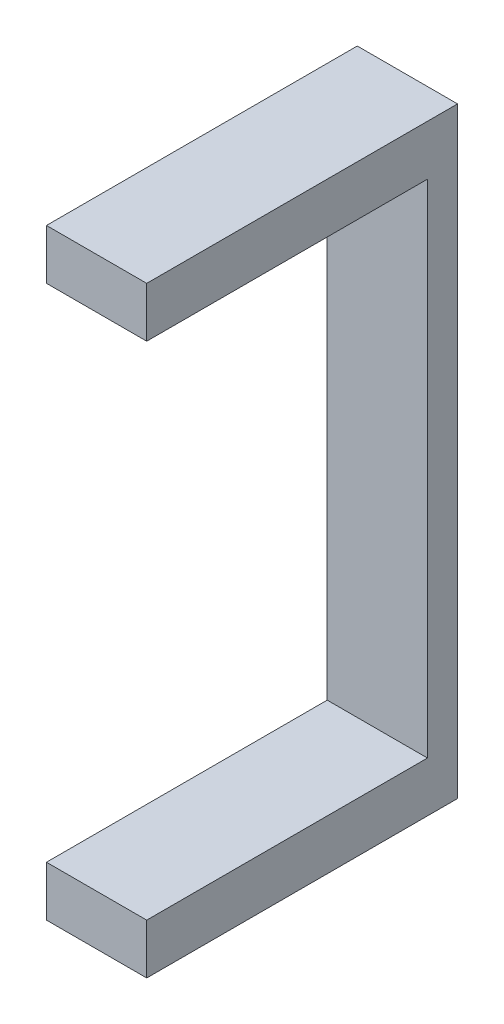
ISO-10303-21;
HEADER;
FILE_DESCRIPTION(('STEP AP214'),'2;1');
FILE_NAME('part.step','',(''),(''),'','','');
FILE_SCHEMA(('AUTOMOTIVE_DESIGN { 1 0 10303 214 1 1 1 1 }'));
ENDSEC;
DATA;
#1=APPLICATION_CONTEXT('core data for automotive mechanical design processes');
#2=APPLICATION_PROTOCOL_DEFINITION('international standard','automotive_design',2000,#1);
#3=PRODUCT_CONTEXT('',#1,'mechanical');
#4=PRODUCT('Part','Part','',(#3));
#5=PRODUCT_RELATED_PRODUCT_CATEGORY('part','',(#4));
#6=PRODUCT_DEFINITION_FORMATION('','',#4);
#7=PRODUCT_DEFINITION_CONTEXT('part definition',#1,'design');
#8=PRODUCT_DEFINITION('design','',#6,#7);
#9=PRODUCT_DEFINITION_SHAPE('','',#8);
#10=(LENGTH_UNIT() NAMED_UNIT(*) SI_UNIT(.MILLI.,.METRE.));
#11=(NAMED_UNIT(*) PLANE_ANGLE_UNIT() SI_UNIT($,.RADIAN.));
#12=(NAMED_UNIT(*) SI_UNIT($,.STERADIAN.) SOLID_ANGLE_UNIT());
#13=UNCERTAINTY_MEASURE_WITH_UNIT(LENGTH_MEASURE(1.E-05),#10,'distance_accuracy_value','');
#14=(GEOMETRIC_REPRESENTATION_CONTEXT(3) GLOBAL_UNCERTAINTY_ASSIGNED_CONTEXT((#13)) GLOBAL_UNIT_ASSIGNED_CONTEXT((#10,
#11,#12)) REPRESENTATION_CONTEXT('',''));
#15=CARTESIAN_POINT('',(0.,0.,0.));
#16=DIRECTION('',(0.,0.,1.));
#17=DIRECTION('',(1.,0.,0.));
#18=AXIS2_PLACEMENT_3D('',#15,#16,#17);
#19=CARTESIAN_POINT('',(0.,0.,3.2));
#20=DIRECTION('',(0.,0.,-1.));
#21=DIRECTION('',(-1.,0.,0.));
#22=AXIS2_PLACEMENT_3D('',#19,#20,#21);
#23=PLANE('',#22);
#24=DIRECTION('',(1.,0.,0.));
#25=VECTOR('',#24,1.);
#26=CARTESIAN_POINT('',(-27.15,5.,3.2));
#27=LINE('',#26,#25);
#28=CARTESIAN_POINT('',(-27.15,5.,3.2));
#29=VERTEX_POINT('',#28);
#30=CARTESIAN_POINT('',(-25.15,5.,3.2));
#31=VERTEX_POINT('',#30);
#32=EDGE_CURVE('E57',#29,#31,#27,.T.);
#33=ORIENTED_EDGE('',*,*,#32,.F.);
#34=DIRECTION('',(0.,-1.,0.));
#35=VECTOR('',#34,1.);
#36=CARTESIAN_POINT('',(-27.15,-6.,3.2));
#37=LINE('',#36,#35);
#38=CARTESIAN_POINT('',(-27.15,-5.,3.2));
#39=VERTEX_POINT('',#38);
#40=EDGE_CURVE('E126',#29,#39,#37,.T.);
#41=ORIENTED_EDGE('',*,*,#40,.T.);
#42=DIRECTION('',(-1.,0.,0.));
#43=VECTOR('',#42,1.);
#44=CARTESIAN_POINT('',(-27.15,-5.,3.2));
#45=LINE('',#44,#43);
#46=CARTESIAN_POINT('',(-25.15,-5.,3.2));
#47=VERTEX_POINT('',#46);
#48=EDGE_CURVE('E61',#47,#39,#45,.T.);
#49=ORIENTED_EDGE('',*,*,#48,.F.);
#50=DIRECTION('',(0.,1.,0.));
#51=VECTOR('',#50,1.);
#52=CARTESIAN_POINT('',(-25.15,-6.,3.2));
#53=LINE('',#52,#51);
#54=EDGE_CURVE('E151',#47,#31,#53,.T.);
#55=ORIENTED_EDGE('',*,*,#54,.T.);
#56=EDGE_LOOP('',(#33,#41,#49,#55));
#57=FACE_BOUND('',#56,.T.);
#58=ADVANCED_FACE('F41',(#57),#23,.F.);
#59=CARTESIAN_POINT('',(-27.15,-6.,3.2));
#60=DIRECTION('',(1.,0.,0.));
#61=DIRECTION('',(0.,0.,-1.));
#62=AXIS2_PLACEMENT_3D('',#59,#60,#61);
#63=PLANE('',#62);
#64=DIRECTION('',(0.,-1.,0.));
#65=VECTOR('',#64,1.);
#66=CARTESIAN_POINT('',(-27.15,-6.,2.6));
#67=LINE('',#66,#65);
#68=CARTESIAN_POINT('',(-27.15,6.,2.6));
#69=VERTEX_POINT('',#68);
#70=CARTESIAN_POINT('',(-27.15,-6.,2.6));
#71=VERTEX_POINT('',#70);
#72=EDGE_CURVE('E149',#69,#71,#67,.T.);
#73=ORIENTED_EDGE('',*,*,#72,.T.);
#74=DIRECTION('',(0.,0.,-1.));
#75=VECTOR('',#74,1.);
#76=CARTESIAN_POINT('',(-27.15,-6.,3.2));
#77=LINE('',#76,#75);
#78=CARTESIAN_POINT('',(-27.15,-6.,8.8));
#79=VERTEX_POINT('',#78);
#80=EDGE_CURVE('E11',#79,#71,#77,.T.);
#81=ORIENTED_EDGE('',*,*,#80,.F.);
#82=DIRECTION('',(0.,-1.,0.));
#83=VECTOR('',#82,1.);
#84=CARTESIAN_POINT('',(-27.15,-6.,8.8));
#85=LINE('',#84,#83);
#86=CARTESIAN_POINT('',(-27.15,-5.,8.8));
#87=VERTEX_POINT('',#86);
#88=EDGE_CURVE('E128',#87,#79,#85,.T.);
#89=ORIENTED_EDGE('',*,*,#88,.F.);
#90=DIRECTION('',(0.,0.,-1.));
#91=VECTOR('',#90,1.);
#92=CARTESIAN_POINT('',(-27.15,-5.,8.8));
#93=LINE('',#92,#91);
#94=EDGE_CURVE('E141',#87,#39,#93,.T.);
#95=ORIENTED_EDGE('',*,*,#94,.T.);
#96=ORIENTED_EDGE('',*,*,#40,.F.);
#97=DIRECTION('',(0.,0.,-1.));
#98=VECTOR('',#97,1.);
#99=CARTESIAN_POINT('',(-27.15,5.,8.8));
#100=LINE('',#99,#98);
#101=CARTESIAN_POINT('',(-27.15,5.,8.8));
#102=VERTEX_POINT('',#101);
#103=EDGE_CURVE('E108',#102,#29,#100,.T.);
#104=ORIENTED_EDGE('',*,*,#103,.F.);
#105=DIRECTION('',(0.,-1.,0.));
#106=VECTOR('',#105,1.);
#107=CARTESIAN_POINT('',(-27.15,5.,8.8));
#108=LINE('',#107,#106);
#109=CARTESIAN_POINT('',(-27.15,6.,8.8));
#110=VERTEX_POINT('',#109);
#111=EDGE_CURVE('E116',#110,#102,#108,.T.);
#112=ORIENTED_EDGE('',*,*,#111,.F.);
#113=DIRECTION('',(0.,0.,-1.));
#114=VECTOR('',#113,1.);
#115=CARTESIAN_POINT('',(-27.15,6.,3.2));
#116=LINE('',#115,#114);
#117=EDGE_CURVE('E152',#110,#69,#116,.T.);
#118=ORIENTED_EDGE('',*,*,#117,.T.);
#119=EDGE_LOOP('',(#73,#81,#89,#95,#96,#104,#112,#118));
#120=FACE_BOUND('',#119,.T.);
#121=ADVANCED_FACE('F43',(#120),#63,.F.);
#122=CARTESIAN_POINT('',(-27.15,-6.,3.2));
#123=DIRECTION('',(0.,1.,0.));
#124=DIRECTION('',(0.,0.,1.));
#125=AXIS2_PLACEMENT_3D('',#122,#123,#124);
#126=PLANE('',#125);
#127=DIRECTION('',(1.,0.,0.));
#128=VECTOR('',#127,1.);
#129=CARTESIAN_POINT('',(-27.15,-6.,2.6));
#130=LINE('',#129,#128);
#131=CARTESIAN_POINT('',(-25.15,-6.,2.6));
#132=VERTEX_POINT('',#131);
#133=EDGE_CURVE('E156',#71,#132,#130,.T.);
#134=ORIENTED_EDGE('',*,*,#133,.T.);
#135=DIRECTION('',(0.,0.,-1.));
#136=VECTOR('',#135,1.);
#137=CARTESIAN_POINT('',(-25.15,-6.,3.2));
#138=LINE('',#137,#136);
#139=CARTESIAN_POINT('',(-25.15,-6.,8.8));
#140=VERTEX_POINT('',#139);
#141=EDGE_CURVE('E47',#140,#132,#138,.T.);
#142=ORIENTED_EDGE('',*,*,#141,.F.);
#143=DIRECTION('',(1.,0.,0.));
#144=VECTOR('',#143,1.);
#145=CARTESIAN_POINT('',(-27.15,-6.,8.8));
#146=LINE('',#145,#144);
#147=EDGE_CURVE('E140',#79,#140,#146,.T.);
#148=ORIENTED_EDGE('',*,*,#147,.F.);
#149=ORIENTED_EDGE('',*,*,#80,.T.);
#150=EDGE_LOOP('',(#134,#142,#148,#149));
#151=FACE_BOUND('',#150,.T.);
#152=ADVANCED_FACE('F179',(#151),#126,.F.);
#153=CARTESIAN_POINT('',(-25.15,-6.,3.2));
#154=DIRECTION('',(-1.,0.,0.));
#155=DIRECTION('',(0.,0.,1.));
#156=AXIS2_PLACEMENT_3D('',#153,#154,#155);
#157=PLANE('',#156);
#158=DIRECTION('',(0.,1.,0.));
#159=VECTOR('',#158,1.);
#160=CARTESIAN_POINT('',(-25.15,-6.,2.6));
#161=LINE('',#160,#159);
#162=CARTESIAN_POINT('',(-25.15,6.,2.6));
#163=VERTEX_POINT('',#162);
#164=EDGE_CURVE('E158',#132,#163,#161,.T.);
#165=ORIENTED_EDGE('',*,*,#164,.T.);
#166=DIRECTION('',(0.,0.,-1.));
#167=VECTOR('',#166,1.);
#168=CARTESIAN_POINT('',(-25.15,6.,3.2));
#169=LINE('',#168,#167);
#170=CARTESIAN_POINT('',(-25.15,6.,8.8));
#171=VERTEX_POINT('',#170);
#172=EDGE_CURVE('E165',#171,#163,#169,.T.);
#173=ORIENTED_EDGE('',*,*,#172,.F.);
#174=DIRECTION('',(0.,1.,0.));
#175=VECTOR('',#174,1.);
#176=CARTESIAN_POINT('',(-25.15,5.,8.8));
#177=LINE('',#176,#175);
#178=CARTESIAN_POINT('',(-25.15,5.,8.8));
#179=VERTEX_POINT('',#178);
#180=EDGE_CURVE('E113',#179,#171,#177,.T.);
#181=ORIENTED_EDGE('',*,*,#180,.F.);
#182=DIRECTION('',(0.,0.,-1.));
#183=VECTOR('',#182,1.);
#184=CARTESIAN_POINT('',(-25.15,5.,8.8));
#185=LINE('',#184,#183);
#186=EDGE_CURVE('E112',#179,#31,#185,.T.);
#187=ORIENTED_EDGE('',*,*,#186,.T.);
#188=ORIENTED_EDGE('',*,*,#54,.F.);
#189=DIRECTION('',(0.,0.,-1.));
#190=VECTOR('',#189,1.);
#191=CARTESIAN_POINT('',(-25.15,-5.,8.8));
#192=LINE('',#191,#190);
#193=CARTESIAN_POINT('',(-25.15,-5.,8.8));
#194=VERTEX_POINT('',#193);
#195=EDGE_CURVE('E148',#194,#47,#192,.T.);
#196=ORIENTED_EDGE('',*,*,#195,.F.);
#197=DIRECTION('',(0.,1.,0.));
#198=VECTOR('',#197,1.);
#199=CARTESIAN_POINT('',(-25.15,-6.,8.8));
#200=LINE('',#199,#198);
#201=EDGE_CURVE('E136',#140,#194,#200,.T.);
#202=ORIENTED_EDGE('',*,*,#201,.F.);
#203=ORIENTED_EDGE('',*,*,#141,.T.);
#204=EDGE_LOOP('',(#165,#173,#181,#187,#188,#196,#202,#203));
#205=FACE_BOUND('',#204,.T.);
#206=ADVANCED_FACE('F169',(#205),#157,.F.);
#207=CARTESIAN_POINT('',(-27.15,6.,3.2));
#208=DIRECTION('',(0.,-1.,0.));
#209=DIRECTION('',(0.,0.,-1.));
#210=AXIS2_PLACEMENT_3D('',#207,#208,#209);
#211=PLANE('',#210);
#212=DIRECTION('',(-1.,0.,0.));
#213=VECTOR('',#212,1.);
#214=CARTESIAN_POINT('',(-27.15,6.,2.6));
#215=LINE('',#214,#213);
#216=EDGE_CURVE('E155',#163,#69,#215,.T.);
#217=ORIENTED_EDGE('',*,*,#216,.T.);
#218=ORIENTED_EDGE('',*,*,#117,.F.);
#219=DIRECTION('',(-1.,0.,0.));
#220=VECTOR('',#219,1.);
#221=CARTESIAN_POINT('',(-27.15,6.,8.8));
#222=LINE('',#221,#220);
#223=EDGE_CURVE('E125',#171,#110,#222,.T.);
#224=ORIENTED_EDGE('',*,*,#223,.F.);
#225=ORIENTED_EDGE('',*,*,#172,.T.);
#226=EDGE_LOOP('',(#217,#218,#224,#225));
#227=FACE_BOUND('',#226,.T.);
#228=ADVANCED_FACE('F180',(#227),#211,.F.);
#229=CARTESIAN_POINT('',(0.,0.,2.6));
#230=DIRECTION('',(0.,0.,-1.));
#231=DIRECTION('',(-1.,0.,0.));
#232=AXIS2_PLACEMENT_3D('',#229,#230,#231);
#233=PLANE('',#232);
#234=ORIENTED_EDGE('',*,*,#72,.F.);
#235=ORIENTED_EDGE('',*,*,#216,.F.);
#236=ORIENTED_EDGE('',*,*,#164,.F.);
#237=ORIENTED_EDGE('',*,*,#133,.F.);
#238=EDGE_LOOP('',(#234,#235,#236,#237));
#239=FACE_BOUND('',#238,.T.);
#240=ADVANCED_FACE('F175',(#239),#233,.T.);
#241=CARTESIAN_POINT('',(-27.15,-5.,8.8));
#242=DIRECTION('',(0.,-1.,0.));
#243=DIRECTION('',(0.,0.,-1.));
#244=AXIS2_PLACEMENT_3D('',#241,#242,#243);
#245=PLANE('',#244);
#246=ORIENTED_EDGE('',*,*,#48,.T.);
#247=ORIENTED_EDGE('',*,*,#94,.F.);
#248=DIRECTION('',(-1.,0.,0.));
#249=VECTOR('',#248,1.);
#250=CARTESIAN_POINT('',(-27.15,-5.,8.8));
#251=LINE('',#250,#249);
#252=EDGE_CURVE('E142',#194,#87,#251,.T.);
#253=ORIENTED_EDGE('',*,*,#252,.F.);
#254=ORIENTED_EDGE('',*,*,#195,.T.);
#255=EDGE_LOOP('',(#246,#247,#253,#254));
#256=FACE_BOUND('',#255,.T.);
#257=ADVANCED_FACE('F183',(#256),#245,.F.);
#258=CARTESIAN_POINT('',(0.,0.,8.8));
#259=DIRECTION('',(0.,0.,-1.));
#260=DIRECTION('',(-1.,0.,0.));
#261=AXIS2_PLACEMENT_3D('',#258,#259,#260);
#262=PLANE('',#261);
#263=ORIENTED_EDGE('',*,*,#88,.T.);
#264=ORIENTED_EDGE('',*,*,#147,.T.);
#265=ORIENTED_EDGE('',*,*,#201,.T.);
#266=ORIENTED_EDGE('',*,*,#252,.T.);
#267=EDGE_LOOP('',(#263,#264,#265,#266));
#268=FACE_BOUND('',#267,.T.);
#269=ADVANCED_FACE('F182',(#268),#262,.F.);
#270=CARTESIAN_POINT('',(-27.15,5.,8.8));
#271=DIRECTION('',(0.,1.,0.));
#272=DIRECTION('',(0.,0.,1.));
#273=AXIS2_PLACEMENT_3D('',#270,#271,#272);
#274=PLANE('',#273);
#275=ORIENTED_EDGE('',*,*,#32,.T.);
#276=ORIENTED_EDGE('',*,*,#186,.F.);
#277=DIRECTION('',(1.,0.,0.));
#278=VECTOR('',#277,1.);
#279=CARTESIAN_POINT('',(-27.15,5.,8.8));
#280=LINE('',#279,#278);
#281=EDGE_CURVE('E104',#102,#179,#280,.T.);
#282=ORIENTED_EDGE('',*,*,#281,.F.);
#283=ORIENTED_EDGE('',*,*,#103,.T.);
#284=EDGE_LOOP('',(#275,#276,#282,#283));
#285=FACE_BOUND('',#284,.T.);
#286=ADVANCED_FACE('F110',(#285),#274,.F.);
#287=CARTESIAN_POINT('',(0.,0.,8.8));
#288=DIRECTION('',(0.,0.,-1.));
#289=DIRECTION('',(-1.,0.,0.));
#290=AXIS2_PLACEMENT_3D('',#287,#288,#289);
#291=PLANE('',#290);
#292=ORIENTED_EDGE('',*,*,#111,.T.);
#293=ORIENTED_EDGE('',*,*,#281,.T.);
#294=ORIENTED_EDGE('',*,*,#180,.T.);
#295=ORIENTED_EDGE('',*,*,#223,.T.);
#296=EDGE_LOOP('',(#292,#293,#294,#295));
#297=FACE_BOUND('',#296,.T.);
#298=ADVANCED_FACE('F120',(#297),#291,.F.);
#299=CLOSED_SHELL('',(#58,#121,#152,#206,#228,#240,#257,#269,#286,#298));
#300=MANIFOLD_SOLID_BREP('B2',#299);
#301=ADVANCED_BREP_SHAPE_REPRESENTATION('',(#18,#300),#14);
#302=SHAPE_DEFINITION_REPRESENTATION(#9,#301);
ENDSEC;
END-ISO-10303-21;
